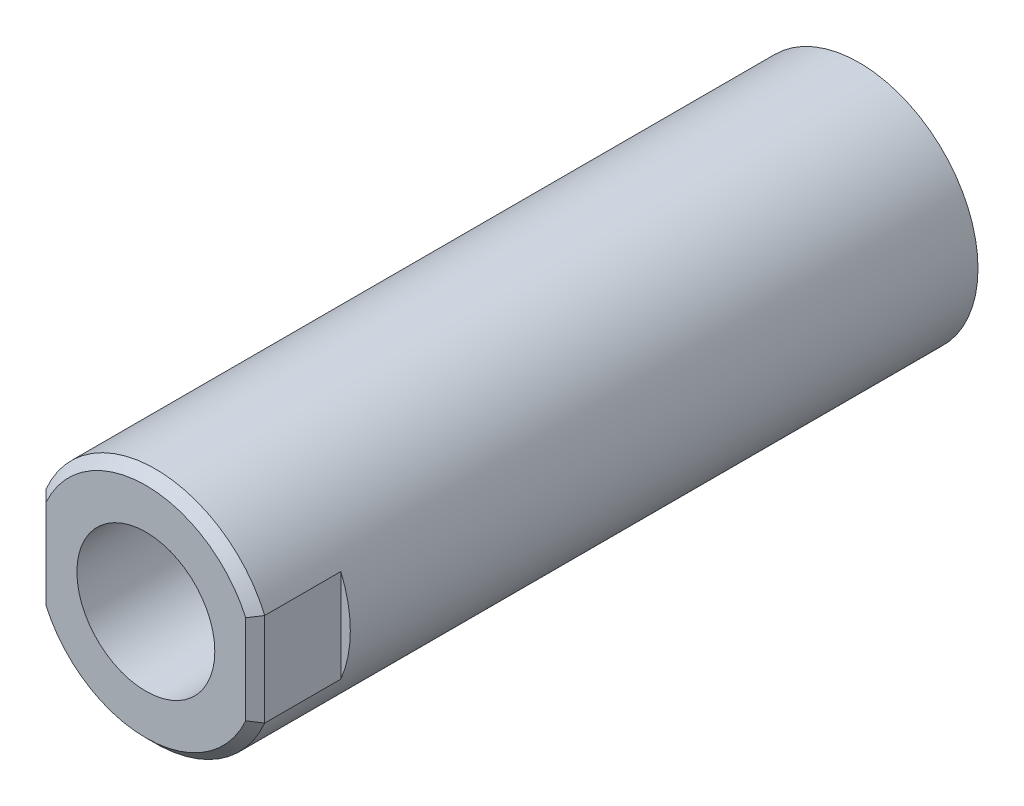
ISO-10303-21;
HEADER;
FILE_DESCRIPTION(('STEP AP214'),'2;1');
FILE_NAME('part.step','',(''),(''),'','','');
FILE_SCHEMA(('AUTOMOTIVE_DESIGN { 1 0 10303 214 1 1 1 1 }'));
ENDSEC;
DATA;
#1=APPLICATION_CONTEXT('core data for automotive mechanical design processes');
#2=APPLICATION_PROTOCOL_DEFINITION('international standard','automotive_design',2000,#1);
#3=PRODUCT_CONTEXT('',#1,'mechanical');
#4=PRODUCT('Part','Part','',(#3));
#5=PRODUCT_RELATED_PRODUCT_CATEGORY('part','',(#4));
#6=PRODUCT_DEFINITION_FORMATION('','',#4);
#7=PRODUCT_DEFINITION_CONTEXT('part definition',#1,'design');
#8=PRODUCT_DEFINITION('design','',#6,#7);
#9=PRODUCT_DEFINITION_SHAPE('','',#8);
#10=(LENGTH_UNIT() NAMED_UNIT(*) SI_UNIT(.MILLI.,.METRE.));
#11=(NAMED_UNIT(*) PLANE_ANGLE_UNIT() SI_UNIT($,.RADIAN.));
#12=(NAMED_UNIT(*) SI_UNIT($,.STERADIAN.) SOLID_ANGLE_UNIT());
#13=UNCERTAINTY_MEASURE_WITH_UNIT(LENGTH_MEASURE(1.E-05),#10,'distance_accuracy_value','');
#14=(GEOMETRIC_REPRESENTATION_CONTEXT(3) GLOBAL_UNCERTAINTY_ASSIGNED_CONTEXT((#13)) GLOBAL_UNIT_ASSIGNED_CONTEXT((#10,
#11,#12)) REPRESENTATION_CONTEXT('',''));
#15=CARTESIAN_POINT('',(0.,0.,0.));
#16=DIRECTION('',(0.,0.,1.));
#17=DIRECTION('',(1.,0.,0.));
#18=AXIS2_PLACEMENT_3D('',#15,#16,#17);
#19=CARTESIAN_POINT('',(0.,0.,-75.));
#20=DIRECTION('',(0.,0.,1.));
#21=DIRECTION('',(1.,0.,0.));
#22=AXIS2_PLACEMENT_3D('',#19,#20,#21);
#23=PLANE('',#22);
#24=CARTESIAN_POINT('',(0.,0.,-75.));
#25=DIRECTION('',(0.,0.,1.));
#26=DIRECTION('',(1.,0.,0.));
#27=AXIS2_PLACEMENT_3D('',#24,#25,#26);
#28=CIRCLE('',#27,12.5);
#29=CARTESIAN_POINT('',(12.5,0.,-75.));
#30=VERTEX_POINT('',#29);
#31=EDGE_CURVE('E206',#30,#30,#28,.T.);
#32=ORIENTED_EDGE('',*,*,#31,.F.);
#33=EDGE_LOOP('',(#32));
#34=FACE_BOUND('',#33,.T.);
#35=ADVANCED_FACE('F37',(#34),#23,.F.);
#36=CARTESIAN_POINT('',(11.5,-10.5,-9.));
#37=DIRECTION('',(0.,0.,-1.));
#38=DIRECTION('',(-1.,0.,0.));
#39=AXIS2_PLACEMENT_3D('',#36,#37,#38);
#40=PLANE('',#39);
#41=CARTESIAN_POINT('',(0.,0.,-8.99999999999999));
#42=DIRECTION('',(0.,0.,-1.));
#43=DIRECTION('',(-1.,0.,0.));
#44=AXIS2_PLACEMENT_3D('',#41,#42,#43);
#45=CIRCLE('',#44,12.5);
#46=CARTESIAN_POINT('',(11.5,-4.89897948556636,-8.99999999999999));
#47=VERTEX_POINT('',#46);
#48=CARTESIAN_POINT('',(11.5,4.89897948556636,-8.99999999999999));
#49=VERTEX_POINT('',#48);
#50=EDGE_CURVE('E209',#47,#49,#45,.F.);
#51=ORIENTED_EDGE('',*,*,#50,.T.);
#52=DIRECTION('',(0.,1.,0.));
#53=VECTOR('',#52,1.);
#54=CARTESIAN_POINT('',(11.5,-10.5,-9.));
#55=LINE('',#54,#53);
#56=EDGE_CURVE('E108',#47,#49,#55,.T.);
#57=ORIENTED_EDGE('',*,*,#56,.F.);
#58=EDGE_LOOP('',(#51,#57));
#59=FACE_BOUND('',#58,.T.);
#60=ADVANCED_FACE('F165',(#59),#40,.F.);
#61=CARTESIAN_POINT('',(-14.,-10.5,-9.));
#62=DIRECTION('',(0.,0.,-1.));
#63=DIRECTION('',(-1.,0.,0.));
#64=AXIS2_PLACEMENT_3D('',#61,#62,#63);
#65=PLANE('',#64);
#66=CARTESIAN_POINT('',(0.,0.,-8.99999999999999));
#67=DIRECTION('',(0.,0.,-1.));
#68=DIRECTION('',(-1.,0.,0.));
#69=AXIS2_PLACEMENT_3D('',#66,#67,#68);
#70=CIRCLE('',#69,12.5);
#71=CARTESIAN_POINT('',(-11.5,4.89897948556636,-9.));
#72=VERTEX_POINT('',#71);
#73=CARTESIAN_POINT('',(-11.5,-4.89897948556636,-8.99999999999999));
#74=VERTEX_POINT('',#73);
#75=EDGE_CURVE('E104',#72,#74,#70,.F.);
#76=ORIENTED_EDGE('',*,*,#75,.T.);
#77=DIRECTION('',(0.,1.,0.));
#78=VECTOR('',#77,1.);
#79=CARTESIAN_POINT('',(-11.5,-10.5,-9.));
#80=LINE('',#79,#78);
#81=EDGE_CURVE('E99',#74,#72,#80,.T.);
#82=ORIENTED_EDGE('',*,*,#81,.T.);
#83=EDGE_LOOP('',(#76,#82));
#84=FACE_BOUND('',#83,.T.);
#85=ADVANCED_FACE('F107',(#84),#65,.F.);
#86=CARTESIAN_POINT('',(0.,0.,-75.));
#87=DIRECTION('',(0.,0.,1.));
#88=DIRECTION('',(1.,0.,0.));
#89=AXIS2_PLACEMENT_3D('',#86,#87,#88);
#90=CYLINDRICAL_SURFACE('',#89,12.5);
#91=DIRECTION('',(0.,0.,1.));
#92=VECTOR('',#91,1.);
#93=CARTESIAN_POINT('',(-11.5,4.89897948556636,-75.));
#94=LINE('',#93,#92);
#95=CARTESIAN_POINT('',(-11.5,4.89897948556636,-0.999999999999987));
#96=VERTEX_POINT('',#95);
#97=EDGE_CURVE('E96',#96,#72,#94,.F.);
#98=ORIENTED_EDGE('',*,*,#97,.F.);
#99=CARTESIAN_POINT('',(0.,0.,-1.));
#100=DIRECTION('',(0.,0.,1.));
#101=DIRECTION('',(1.,0.,0.));
#102=AXIS2_PLACEMENT_3D('',#99,#100,#101);
#103=CIRCLE('',#102,12.5);
#104=CARTESIAN_POINT('',(11.5,4.89897948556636,-0.999999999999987));
#105=VERTEX_POINT('',#104);
#106=EDGE_CURVE('E50',#96,#105,#103,.F.);
#107=ORIENTED_EDGE('',*,*,#106,.T.);
#108=DIRECTION('',(0.,0.,1.));
#109=VECTOR('',#108,1.);
#110=CARTESIAN_POINT('',(11.5,4.89897948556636,-75.));
#111=LINE('',#110,#109);
#112=EDGE_CURVE('E215',#49,#105,#111,.T.);
#113=ORIENTED_EDGE('',*,*,#112,.F.);
#114=ORIENTED_EDGE('',*,*,#50,.F.);
#115=DIRECTION('',(0.,0.,1.));
#116=VECTOR('',#115,1.);
#117=CARTESIAN_POINT('',(11.5,-4.89897948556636,-75.));
#118=LINE('',#117,#116);
#119=CARTESIAN_POINT('',(11.5,-4.89897948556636,-0.999999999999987));
#120=VERTEX_POINT('',#119);
#121=EDGE_CURVE('E115',#120,#47,#118,.F.);
#122=ORIENTED_EDGE('',*,*,#121,.F.);
#123=CARTESIAN_POINT('',(0.,0.,-1.));
#124=DIRECTION('',(0.,0.,1.));
#125=DIRECTION('',(1.,0.,0.));
#126=AXIS2_PLACEMENT_3D('',#123,#124,#125);
#127=CIRCLE('',#126,12.5);
#128=CARTESIAN_POINT('',(-11.5,-4.89897948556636,-0.999999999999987));
#129=VERTEX_POINT('',#128);
#130=EDGE_CURVE('E58',#120,#129,#127,.F.);
#131=ORIENTED_EDGE('',*,*,#130,.T.);
#132=DIRECTION('',(0.,0.,1.));
#133=VECTOR('',#132,1.);
#134=CARTESIAN_POINT('',(-11.5,-4.89897948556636,-75.));
#135=LINE('',#134,#133);
#136=EDGE_CURVE('E113',#74,#129,#135,.T.);
#137=ORIENTED_EDGE('',*,*,#136,.F.);
#138=ORIENTED_EDGE('',*,*,#75,.F.);
#139=EDGE_LOOP('',(#98,#107,#113,#114,#122,#131,#137,#138));
#140=FACE_BOUND('',#139,.T.);
#141=ORIENTED_EDGE('',*,*,#31,.T.);
#142=EDGE_LOOP('',(#141));
#143=FACE_BOUND('',#142,.T.);
#144=ADVANCED_FACE('F111',(#140,#143),#90,.T.);
#145=CARTESIAN_POINT('',(11.5,-10.5,0.));
#146=DIRECTION('',(-1.,0.,0.));
#147=DIRECTION('',(0.,0.,1.));
#148=AXIS2_PLACEMENT_3D('',#145,#146,#147);
#149=PLANE('',#148);
#150=ORIENTED_EDGE('',*,*,#112,.T.);
#151=DIRECTION('',(0.,-1.,0.));
#152=VECTOR('',#151,1.);
#153=CARTESIAN_POINT('',(11.5,-4.89897948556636,-0.999999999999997));
#154=LINE('',#153,#152);
#155=EDGE_CURVE('E127',#105,#120,#154,.T.);
#156=ORIENTED_EDGE('',*,*,#155,.T.);
#157=ORIENTED_EDGE('',*,*,#121,.T.);
#158=ORIENTED_EDGE('',*,*,#56,.T.);
#159=EDGE_LOOP('',(#150,#156,#157,#158));
#160=FACE_BOUND('',#159,.T.);
#161=ADVANCED_FACE('F178',(#160),#149,.F.);
#162=CARTESIAN_POINT('',(-11.5,-10.5,0.));
#163=DIRECTION('',(1.,0.,0.));
#164=DIRECTION('',(0.,0.,-1.));
#165=AXIS2_PLACEMENT_3D('',#162,#163,#164);
#166=PLANE('',#165);
#167=ORIENTED_EDGE('',*,*,#136,.T.);
#168=DIRECTION('',(0.,1.,0.));
#169=VECTOR('',#168,1.);
#170=CARTESIAN_POINT('',(-11.5,4.89897948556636,-0.999999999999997));
#171=LINE('',#170,#169);
#172=EDGE_CURVE('E11',#129,#96,#171,.T.);
#173=ORIENTED_EDGE('',*,*,#172,.T.);
#174=ORIENTED_EDGE('',*,*,#97,.T.);
#175=ORIENTED_EDGE('',*,*,#81,.F.);
#176=EDGE_LOOP('',(#167,#173,#174,#175));
#177=FACE_BOUND('',#176,.T.);
#178=ADVANCED_FACE('F98',(#177),#166,.F.);
#179=CARTESIAN_POINT('',(0.,0.,0.));
#180=DIRECTION('',(0.,0.,1.));
#181=DIRECTION('',(1.,0.,0.));
#182=AXIS2_PLACEMENT_3D('',#179,#180,#181);
#183=PLANE('',#182);
#184=CARTESIAN_POINT('',(0.,0.,0.));
#185=DIRECTION('',(0.,0.,1.));
#186=DIRECTION('',(1.,0.,0.));
#187=AXIS2_PLACEMENT_3D('',#184,#185,#186);
#188=CIRCLE('',#187,11.5);
#189=CARTESIAN_POINT('',(-10.4999999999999,-4.69041575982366,0.));
#190=VERTEX_POINT('',#189);
#191=CARTESIAN_POINT('',(10.4999999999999,-4.69041575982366,0.));
#192=VERTEX_POINT('',#191);
#193=EDGE_CURVE('E103',#190,#192,#188,.T.);
#194=ORIENTED_EDGE('',*,*,#193,.T.);
#195=DIRECTION('',(0.,1.,0.));
#196=VECTOR('',#195,1.);
#197=CARTESIAN_POINT('',(10.5,4.89897948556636,0.));
#198=LINE('',#197,#196);
#199=CARTESIAN_POINT('',(10.4999999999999,4.69041575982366,0.));
#200=VERTEX_POINT('',#199);
#201=EDGE_CURVE('E124',#192,#200,#198,.T.);
#202=ORIENTED_EDGE('',*,*,#201,.T.);
#203=CARTESIAN_POINT('',(0.,0.,0.));
#204=DIRECTION('',(0.,0.,1.));
#205=DIRECTION('',(1.,0.,0.));
#206=AXIS2_PLACEMENT_3D('',#203,#204,#205);
#207=CIRCLE('',#206,11.5);
#208=CARTESIAN_POINT('',(-10.5,4.69041575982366,0.));
#209=VERTEX_POINT('',#208);
#210=EDGE_CURVE('E122',#200,#209,#207,.T.);
#211=ORIENTED_EDGE('',*,*,#210,.T.);
#212=DIRECTION('',(0.,-1.,0.));
#213=VECTOR('',#212,1.);
#214=CARTESIAN_POINT('',(-10.5,-4.89897948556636,0.));
#215=LINE('',#214,#213);
#216=EDGE_CURVE('E120',#209,#190,#215,.T.);
#217=ORIENTED_EDGE('',*,*,#216,.T.);
#218=EDGE_LOOP('',(#194,#202,#211,#217));
#219=FACE_BOUND('',#218,.T.);
#220=CARTESIAN_POINT('',(0.,0.,0.));
#221=DIRECTION('',(0.,0.,-1.));
#222=DIRECTION('',(-1.,0.,0.));
#223=AXIS2_PLACEMENT_3D('',#220,#221,#222);
#224=CIRCLE('',#223,7.25);
#225=CARTESIAN_POINT('',(-7.25,0.,0.));
#226=VERTEX_POINT('',#225);
#227=EDGE_CURVE('E109',#226,#226,#224,.F.);
#228=ORIENTED_EDGE('',*,*,#227,.F.);
#229=EDGE_LOOP('',(#228));
#230=FACE_BOUND('',#229,.T.);
#231=ADVANCED_FACE('F191',(#219,#230),#183,.T.);
#232=CARTESIAN_POINT('',(0.,0.,12.));
#233=DIRECTION('',(0.,0.,1.));
#234=DIRECTION('',(1.,0.,0.));
#235=AXIS2_PLACEMENT_3D('',#232,#233,#234);
#236=CYLINDRICAL_SURFACE('',#235,7.25);
#237=ORIENTED_EDGE('',*,*,#227,.T.);
#238=EDGE_LOOP('',(#237));
#239=FACE_BOUND('',#238,.T.);
#240=CARTESIAN_POINT('',(0.,0.,-17.5));
#241=DIRECTION('',(0.,0.,1.));
#242=DIRECTION('',(1.,0.,0.));
#243=AXIS2_PLACEMENT_3D('',#240,#241,#242);
#244=CIRCLE('',#243,7.24999999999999);
#245=CARTESIAN_POINT('',(7.24999999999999,0.,-17.5));
#246=VERTEX_POINT('',#245);
#247=EDGE_CURVE('E204',#246,#246,#244,.T.);
#248=ORIENTED_EDGE('',*,*,#247,.F.);
#249=EDGE_LOOP('',(#248));
#250=FACE_BOUND('',#249,.T.);
#251=ADVANCED_FACE('F175',(#239,#250),#236,.F.);
#252=CARTESIAN_POINT('',(0.,0.,-17.5));
#253=DIRECTION('',(0.,0.,1.));
#254=DIRECTION('',(1.,0.,0.));
#255=AXIS2_PLACEMENT_3D('',#252,#253,#254);
#256=CONICAL_SURFACE('',#255,7.24999999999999,1.02974425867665);
#257=CARTESIAN_POINT('',(0.,0.,-21.8562394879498));
#258=VERTEX_POINT('',#257);
#259=VERTEX_LOOP('',#258);
#260=FACE_BOUND('',#259,.T.);
#261=ORIENTED_EDGE('',*,*,#247,.T.);
#262=EDGE_LOOP('',(#261));
#263=FACE_BOUND('',#262,.T.);
#264=ADVANCED_FACE('F161',(#260,#263),#256,.F.);
#265=CARTESIAN_POINT('',(-11.5,-10.5,-0.999999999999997));
#266=DIRECTION('',(-0.70710678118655,0.,0.707106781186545));
#267=DIRECTION('',(0.707106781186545,0.,0.70710678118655));
#268=AXIS2_PLACEMENT_3D('',#265,#266,#267);
#269=PLANE('',#268);
#270=CARTESIAN_POINT('',(-10.4999999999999,4.69041575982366,0.));
#271=CARTESIAN_POINT('',(-10.6665895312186,4.72591623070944,-0.166589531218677));
#272=CARTESIAN_POINT('',(-10.8332176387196,4.76104677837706,-0.333217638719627));
#273=CARTESIAN_POINT('',(-11.1665509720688,4.83056802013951,-0.666550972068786));
#274=CARTESIAN_POINT('',(-11.3332561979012,4.86495871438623,-0.833256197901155));
#275=CARTESIAN_POINT('',(-11.5,4.89897948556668,-0.999999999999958));
#276=B_SPLINE_CURVE_WITH_KNOTS('',3,(#270,#271,#272,#273,#274,#275),.UNSPECIFIED.,.F.,.F.,(4,2,
4),(0.,0.714755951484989,1.42951175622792),.UNSPECIFIED.);
#277=EDGE_CURVE('E227',#96,#209,#276,.F.);
#278=ORIENTED_EDGE('',*,*,#277,.F.);
#279=ORIENTED_EDGE('',*,*,#172,.F.);
#280=CARTESIAN_POINT('',(-10.5,-4.6904157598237,0.));
#281=CARTESIAN_POINT('',(-10.6665895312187,-4.72591623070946,-0.166589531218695));
#282=CARTESIAN_POINT('',(-10.8332176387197,-4.76104677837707,-0.333217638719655));
#283=CARTESIAN_POINT('',(-11.1665509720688,-4.83056802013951,-0.666550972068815));
#284=CARTESIAN_POINT('',(-11.3332561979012,-4.86495871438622,-0.833256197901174));
#285=CARTESIAN_POINT('',(-11.5,-4.89897948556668,-0.999999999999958));
#286=B_SPLINE_CURVE_WITH_KNOTS('',3,(#280,#281,#282,#283,#284,#285),.UNSPECIFIED.,.F.,.F.,(4,2,
4),(0.,0.714755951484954,1.42951175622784),.UNSPECIFIED.);
#287=EDGE_CURVE('E42',#190,#129,#286,.T.);
#288=ORIENTED_EDGE('',*,*,#287,.F.);
#289=ORIENTED_EDGE('',*,*,#216,.F.);
#290=EDGE_LOOP('',(#278,#279,#288,#289));
#291=FACE_BOUND('',#290,.T.);
#292=ADVANCED_FACE('F39',(#291),#269,.T.);
#293=CARTESIAN_POINT('',(0.,0.,0.));
#294=DIRECTION('',(0.,0.,-1.));
#295=DIRECTION('',(-1.,0.,0.));
#296=AXIS2_PLACEMENT_3D('',#293,#294,#295);
#297=CONICAL_SURFACE('',#296,11.5,0.785398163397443);
#298=ORIENTED_EDGE('',*,*,#287,.T.);
#299=ORIENTED_EDGE('',*,*,#130,.F.);
#300=CARTESIAN_POINT('',(11.5,-4.89897948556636,-0.999999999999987));
#301=CARTESIAN_POINT('',(11.3332561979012,-4.86495871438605,-0.833256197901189));
#302=CARTESIAN_POINT('',(11.1665509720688,-4.83056802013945,-0.66655097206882));
#303=CARTESIAN_POINT('',(10.8332176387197,-4.76104677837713,-0.33321763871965));
#304=CARTESIAN_POINT('',(10.6665895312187,-4.72591623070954,-0.166589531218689));
#305=CARTESIAN_POINT('',(10.5,-4.69041575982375,0.));
#306=B_SPLINE_CURVE_WITH_KNOTS('',3,(#300,#301,#302,#303,#304,#305),.UNSPECIFIED.,.F.,.F.,(4,2,
4),(0.,0.714755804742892,1.42951175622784),.UNSPECIFIED.);
#307=EDGE_CURVE('E139',#192,#120,#306,.F.);
#308=ORIENTED_EDGE('',*,*,#307,.F.);
#309=ORIENTED_EDGE('',*,*,#193,.F.);
#310=EDGE_LOOP('',(#298,#299,#308,#309));
#311=FACE_BOUND('',#310,.T.);
#312=ADVANCED_FACE('F150',(#311),#297,.T.);
#313=CARTESIAN_POINT('',(0.,0.,0.));
#314=DIRECTION('',(0.,0.,-1.));
#315=DIRECTION('',(-1.,0.,0.));
#316=AXIS2_PLACEMENT_3D('',#313,#314,#315);
#317=CONICAL_SURFACE('',#316,11.5,0.785398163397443);
#318=ORIENTED_EDGE('',*,*,#277,.T.);
#319=ORIENTED_EDGE('',*,*,#210,.F.);
#320=CARTESIAN_POINT('',(10.5,4.6904157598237,0.));
#321=CARTESIAN_POINT('',(10.6665895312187,4.72591623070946,-0.166589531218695));
#322=CARTESIAN_POINT('',(10.8332176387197,4.76104677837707,-0.333217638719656));
#323=CARTESIAN_POINT('',(11.1665509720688,4.83056802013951,-0.666550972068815));
#324=CARTESIAN_POINT('',(11.3332561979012,4.86495871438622,-0.833256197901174));
#325=CARTESIAN_POINT('',(11.5,4.89897948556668,-0.999999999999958));
#326=B_SPLINE_CURVE_WITH_KNOTS('',3,(#320,#321,#322,#323,#324,#325),.UNSPECIFIED.,.F.,.F.,(4,2,
4),(0.,0.714755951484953,1.42951175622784),.UNSPECIFIED.);
#327=EDGE_CURVE('E132',#105,#200,#326,.F.);
#328=ORIENTED_EDGE('',*,*,#327,.F.);
#329=ORIENTED_EDGE('',*,*,#106,.F.);
#330=EDGE_LOOP('',(#318,#319,#328,#329));
#331=FACE_BOUND('',#330,.T.);
#332=ADVANCED_FACE('F143',(#331),#317,.T.);
#333=CARTESIAN_POINT('',(10.5,0.,0.));
#334=DIRECTION('',(0.70710678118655,0.,0.707106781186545));
#335=DIRECTION('',(0.707106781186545,0.,-0.70710678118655));
#336=AXIS2_PLACEMENT_3D('',#333,#334,#335);
#337=PLANE('',#336);
#338=ORIENTED_EDGE('',*,*,#307,.T.);
#339=ORIENTED_EDGE('',*,*,#155,.F.);
#340=ORIENTED_EDGE('',*,*,#327,.T.);
#341=ORIENTED_EDGE('',*,*,#201,.F.);
#342=EDGE_LOOP('',(#338,#339,#340,#341));
#343=FACE_BOUND('',#342,.T.);
#344=ADVANCED_FACE('F146',(#343),#337,.T.);
#345=CLOSED_SHELL('',(#35,#60,#85,#144,#161,#178,#231,#251,#264,#292,#312,#332,#344));
#346=MANIFOLD_SOLID_BREP('B2',#345);
#347=ADVANCED_BREP_SHAPE_REPRESENTATION('',(#18,#346),#14);
#348=SHAPE_DEFINITION_REPRESENTATION(#9,#347);
ENDSEC;
END-ISO-10303-21;
